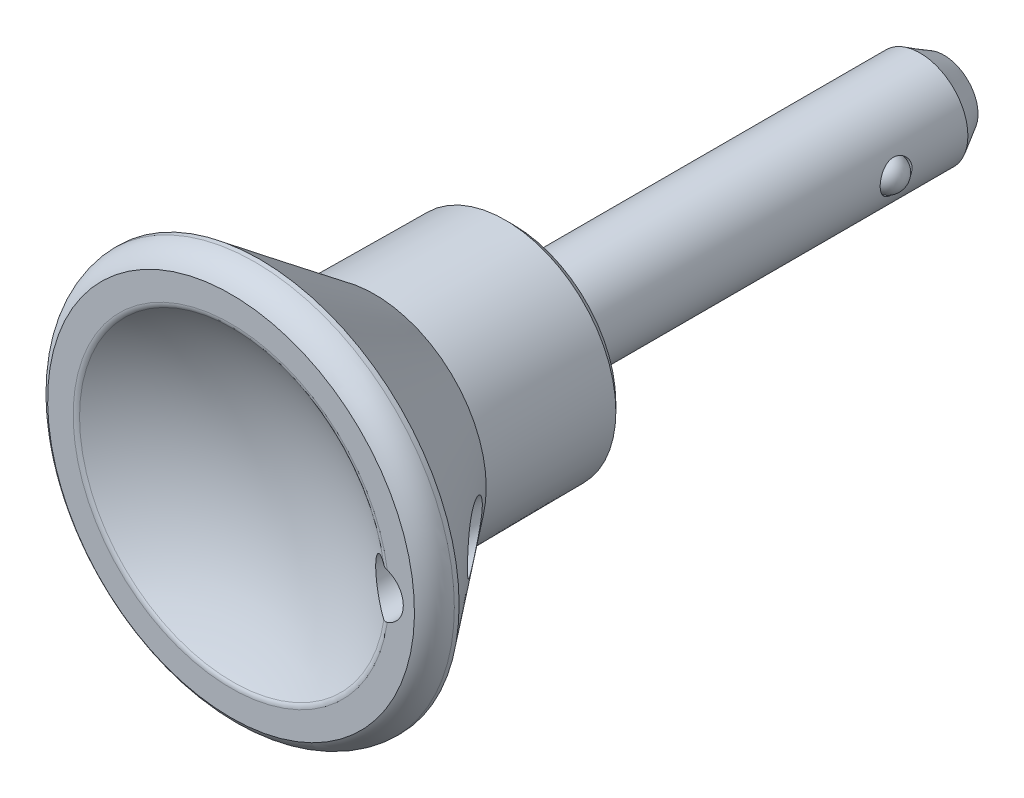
ISO-10303-21;
HEADER;
FILE_DESCRIPTION(('STEP AP214'),'2;1');
FILE_NAME('part.step','',(''),(''),'','','');
FILE_SCHEMA(('AUTOMOTIVE_DESIGN { 1 0 10303 214 1 1 1 1 }'));
ENDSEC;
DATA;
#1=APPLICATION_CONTEXT('core data for automotive mechanical design processes');
#2=APPLICATION_PROTOCOL_DEFINITION('international standard','automotive_design',2000,#1);
#3=PRODUCT_CONTEXT('',#1,'mechanical');
#4=PRODUCT('Part','Part','',(#3));
#5=PRODUCT_RELATED_PRODUCT_CATEGORY('part','',(#4));
#6=PRODUCT_DEFINITION_FORMATION('','',#4);
#7=PRODUCT_DEFINITION_CONTEXT('part definition',#1,'design');
#8=PRODUCT_DEFINITION('design','',#6,#7);
#9=PRODUCT_DEFINITION_SHAPE('','',#8);
#10=(LENGTH_UNIT() NAMED_UNIT(*) SI_UNIT(.MILLI.,.METRE.));
#11=(NAMED_UNIT(*) PLANE_ANGLE_UNIT() SI_UNIT($,.RADIAN.));
#12=(NAMED_UNIT(*) SI_UNIT($,.STERADIAN.) SOLID_ANGLE_UNIT());
#13=UNCERTAINTY_MEASURE_WITH_UNIT(LENGTH_MEASURE(1.E-05),#10,'distance_accuracy_value','');
#14=(GEOMETRIC_REPRESENTATION_CONTEXT(3) GLOBAL_UNCERTAINTY_ASSIGNED_CONTEXT((#13)) GLOBAL_UNIT_ASSIGNED_CONTEXT((#10,
#11,#12)) REPRESENTATION_CONTEXT('',''));
#15=CARTESIAN_POINT('',(0.,0.,0.));
#16=DIRECTION('',(0.,0.,1.));
#17=DIRECTION('',(1.,0.,0.));
#18=AXIS2_PLACEMENT_3D('',#15,#16,#17);
#19=CARTESIAN_POINT('',(2.49,0.,-21.));
#20=DIRECTION('',(0.,-1.,0.));
#21=DIRECTION('',(0.,0.,-1.));
#22=AXIS2_PLACEMENT_3D('',#19,#20,#21);
#23=SPHERICAL_SURFACE('',#22,1.01);
#24=CARTESIAN_POINT('',(2.63177446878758,0.,-21.));
#25=DIRECTION('',(1.,0.,0.));
#26=DIRECTION('',(0.,-1.,0.));
#27=AXIS2_PLACEMENT_3D('',#24,#25,#26);
#28=CIRCLE('',#27,1.);
#29=CARTESIAN_POINT('',(2.63177446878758,-0.999999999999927,-21.));
#30=VERTEX_POINT('',#29);
#31=EDGE_CURVE('E19',#30,#30,#28,.F.);
#32=ORIENTED_EDGE('',*,*,#31,.F.);
#33=EDGE_LOOP('',(#32));
#34=FACE_BOUND('',#33,.T.);
#35=ADVANCED_FACE('F15',(#34),#23,.T.);
#36=CARTESIAN_POINT('',(2.13397459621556,-2.15958441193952,-27.));
#37=DIRECTION('',(0.,0.,-1.));
#38=DIRECTION('',(-1.,0.,0.));
#39=AXIS2_PLACEMENT_3D('',#36,#37,#38);
#40=PLANE('',#39);
#41=CARTESIAN_POINT('',(0.,0.,-27.));
#42=DIRECTION('',(0.,0.,1.));
#43=DIRECTION('',(0.,-1.,0.));
#44=AXIS2_PLACEMENT_3D('',#41,#42,#43);
#45=CIRCLE('',#44,2.13397459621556);
#46=CARTESIAN_POINT('',(0.,-2.13397459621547,-27.));
#47=VERTEX_POINT('',#46);
#48=EDGE_CURVE('E149',#47,#47,#45,.T.);
#49=ORIENTED_EDGE('',*,*,#48,.F.);
#50=EDGE_LOOP('',(#49));
#51=FACE_BOUND('',#50,.T.);
#52=ADVANCED_FACE('F168',(#51),#40,.T.);
#53=CARTESIAN_POINT('',(2.63177446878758,0.,-21.));
#54=DIRECTION('',(1.,0.,0.));
#55=DIRECTION('',(0.,-1.,0.));
#56=AXIS2_PLACEMENT_3D('',#53,#54,#55);
#57=CYLINDRICAL_SURFACE('',#56,1.);
#58=ORIENTED_EDGE('',*,*,#31,.T.);
#59=EDGE_LOOP('',(#58));
#60=FACE_BOUND('',#59,.T.);
#61=CARTESIAN_POINT('',(3.,0.,-22.));
#62=CARTESIAN_POINT('',(2.99999782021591,-0.0544873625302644,-21.9999969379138));
#63=CARTESIAN_POINT('',(2.99849945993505,-0.109030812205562,-21.9955259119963));
#64=CARTESIAN_POINT('',(2.99265949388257,-0.216567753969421,-21.9777925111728));
#65=CARTESIAN_POINT('',(2.98831315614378,-0.269558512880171,-21.9645155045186));
#66=CARTESIAN_POINT('',(2.9772520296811,-0.372338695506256,-21.9296777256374));
#67=CARTESIAN_POINT('',(2.97054267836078,-0.422135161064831,-21.9081359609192));
#68=CARTESIAN_POINT('',(2.95544181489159,-0.517390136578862,-21.8574495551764));
#69=CARTESIAN_POINT('',(2.94705050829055,-0.562849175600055,-21.8283058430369));
#70=CARTESIAN_POINT('',(2.9291411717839,-0.649740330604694,-21.7621750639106));
#71=CARTESIAN_POINT('',(2.9195960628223,-0.691001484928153,-21.7249707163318));
#72=CARTESIAN_POINT('',(2.90060364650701,-0.766830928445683,-21.6442351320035));
#73=CARTESIAN_POINT('',(2.89115636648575,-0.801397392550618,-21.6007021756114));
#74=CARTESIAN_POINT('',(2.87313330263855,-0.863825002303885,-21.5070147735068));
#75=CARTESIAN_POINT('',(2.86459035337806,-0.891464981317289,-21.4567060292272));
#76=CARTESIAN_POINT('',(2.84975302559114,-0.937818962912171,-21.3518236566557));
#77=CARTESIAN_POINT('',(2.84345795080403,-0.956535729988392,-21.29725135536));
#78=CARTESIAN_POINT('',(2.83411303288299,-0.983873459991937,-21.187326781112));
#79=CARTESIAN_POINT('',(2.83096095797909,-0.992813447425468,-21.1320627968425));
#80=CARTESIAN_POINT('',(2.82795656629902,-1.00134112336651,-21.020736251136));
#81=CARTESIAN_POINT('',(2.82810323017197,-1.00093170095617,-20.9646739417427));
#82=CARTESIAN_POINT('',(2.83159014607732,-0.991019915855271,-20.8560634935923));
#83=CARTESIAN_POINT('',(2.83478414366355,-0.981933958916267,-20.8034718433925));
#84=CARTESIAN_POINT('',(2.84376655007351,-0.95560624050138,-20.7006068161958));
#85=CARTESIAN_POINT('',(2.84955528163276,-0.938363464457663,-20.6503337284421));
#86=CARTESIAN_POINT('',(2.86317929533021,-0.895938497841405,-20.5525859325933));
#87=CARTESIAN_POINT('',(2.87104608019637,-0.870632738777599,-20.5051694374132));
#88=CARTESIAN_POINT('',(2.88792606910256,-0.812887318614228,-20.4151267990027));
#89=CARTESIAN_POINT('',(2.89693954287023,-0.780445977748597,-20.3725017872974));
#90=CARTESIAN_POINT('',(2.91567165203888,-0.707355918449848,-20.2909155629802));
#91=CARTESIAN_POINT('',(2.92540257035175,-0.666367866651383,-20.2522605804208));
#92=CARTESIAN_POINT('',(2.94406631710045,-0.578354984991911,-20.1822794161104));
#93=CARTESIAN_POINT('',(2.95299879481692,-0.531327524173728,-20.1509564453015));
#94=CARTESIAN_POINT('',(2.96917806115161,-0.431907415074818,-20.0962803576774));
#95=CARTESIAN_POINT('',(2.97640595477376,-0.379463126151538,-20.073015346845));
#96=CARTESIAN_POINT('',(2.98821351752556,-0.271163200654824,-20.0357719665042));
#97=CARTESIAN_POINT('',(2.99279860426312,-0.215314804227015,-20.0217745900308));
#98=CARTESIAN_POINT('',(2.99719039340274,-0.13245787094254,-20.0084544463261));
#99=CARTESIAN_POINT('',(2.99824082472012,-0.106081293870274,-20.0052879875));
#100=CARTESIAN_POINT('',(2.9996461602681,-0.0531409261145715,-20.0010600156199));
#101=CARTESIAN_POINT('',(3.00000106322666,-0.0265771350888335,-19.9999985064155));
#102=CARTESIAN_POINT('',(2.99999782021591,0.0544873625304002,-20.0000030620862));
#103=CARTESIAN_POINT('',(2.99849945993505,0.109030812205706,-20.0044740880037));
#104=CARTESIAN_POINT('',(2.99265949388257,0.216567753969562,-20.0222074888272));
#105=CARTESIAN_POINT('',(2.98831315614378,0.2695585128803,-20.0354844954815));
#106=CARTESIAN_POINT('',(2.9772520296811,0.372338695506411,-20.0703222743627));
#107=CARTESIAN_POINT('',(2.97054267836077,0.422135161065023,-20.0918640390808));
#108=CARTESIAN_POINT('',(2.95544181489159,0.517390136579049,-20.1425504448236));
#109=CARTESIAN_POINT('',(2.94705050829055,0.5628491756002,-20.1716941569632));
#110=CARTESIAN_POINT('',(2.9291411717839,0.64974033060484,-20.2378249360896));
#111=CARTESIAN_POINT('',(2.91959606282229,0.691001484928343,-20.2750292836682));
#112=CARTESIAN_POINT('',(2.900603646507,0.766830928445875,-20.3557648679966));
#113=CARTESIAN_POINT('',(2.89115636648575,0.801397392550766,-20.3992978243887));
#114=CARTESIAN_POINT('',(2.87313330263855,0.863825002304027,-20.4929852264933));
#115=CARTESIAN_POINT('',(2.86459035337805,0.891464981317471,-20.5432939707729));
#116=CARTESIAN_POINT('',(2.84975302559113,0.937818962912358,-20.6481763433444));
#117=CARTESIAN_POINT('',(2.84345795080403,0.956535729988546,-20.7027486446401));
#118=CARTESIAN_POINT('',(2.834113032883,0.983873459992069,-20.8126732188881));
#119=CARTESIAN_POINT('',(2.83096095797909,0.992813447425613,-20.8679372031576));
#120=CARTESIAN_POINT('',(2.82795656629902,1.00134112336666,-20.979263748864));
#121=CARTESIAN_POINT('',(2.82810323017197,1.00093170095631,-21.0353260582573));
#122=CARTESIAN_POINT('',(2.83159014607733,0.99101991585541,-21.1439365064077));
#123=CARTESIAN_POINT('',(2.83478414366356,0.981933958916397,-21.1965281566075));
#124=CARTESIAN_POINT('',(2.84376655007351,0.95560624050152,-21.2993931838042));
#125=CARTESIAN_POINT('',(2.84955528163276,0.938363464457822,-21.349666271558));
#126=CARTESIAN_POINT('',(2.86317929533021,0.895938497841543,-21.4474140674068));
#127=CARTESIAN_POINT('',(2.87104608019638,0.870632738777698,-21.4948305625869));
#128=CARTESIAN_POINT('',(2.88792606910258,0.812887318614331,-21.5848732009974));
#129=CARTESIAN_POINT('',(2.89693954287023,0.780445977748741,-21.6274982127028));
#130=CARTESIAN_POINT('',(2.91567165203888,0.707355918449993,-21.7090844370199));
#131=CARTESIAN_POINT('',(2.92540257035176,0.666367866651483,-21.7477394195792));
#132=CARTESIAN_POINT('',(2.94406631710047,0.578354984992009,-21.8177205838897));
#133=CARTESIAN_POINT('',(2.95299879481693,0.531327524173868,-21.8490435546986));
#134=CARTESIAN_POINT('',(2.96917806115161,0.431907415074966,-21.9037196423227));
#135=CARTESIAN_POINT('',(2.97640595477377,0.37946312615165,-21.926984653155));
#136=CARTESIAN_POINT('',(2.98821351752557,0.271163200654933,-21.9642280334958));
#137=CARTESIAN_POINT('',(2.99279860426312,0.215314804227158,-21.9782254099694));
#138=CARTESIAN_POINT('',(2.99719039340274,0.132457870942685,-21.991545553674));
#139=CARTESIAN_POINT('',(2.99824082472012,0.106081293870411,-21.9947120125));
#140=CARTESIAN_POINT('',(2.9996461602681,0.0531409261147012,-21.9989399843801));
#141=CARTESIAN_POINT('',(3.00000106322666,0.0265771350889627,-22.0000014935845));
#142=CARTESIAN_POINT('',(3.,0.,-22.));
#143=B_SPLINE_CURVE_WITH_KNOTS('',3,(#61,#62,#63,#64,#65,#66,#67,#68,#69,#70,#71,#72,#73,#74,
#75,#76,#77,#78,#79,#80,#81,#82,#83,#84,#85,#86,#87,#88,#89,#90,#91,#92,#93,#94,#95,#96,#97,#98,
#99,#100,#101,#102,#103,#104,#105,#106,#107,#108,#109,#110,#111,#112,#113,#114,#115,#116,#117,
#118,#119,#120,#121,#122,#123,#124,#125,#126,#127,#128,#129,#130,#131,#132,#133,#134,#135,#136,
#137,#138,#139,#140,#141,#142),.UNSPECIFIED.,.T.,.F.,(4,2,2,2,2,2,2,2,2,2,2,2,2,2,2,2,2,2,2,2,2,
2,2,2,2,2,2,2,2,2,2,2,2,2,2,2,2,2,2,2,4),(0.,0.163359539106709,0.326991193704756,
0.490248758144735,0.653486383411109,0.8218424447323,0.990244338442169,1.16348424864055,
1.33667045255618,1.50401925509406,1.6713163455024,1.83096789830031,1.99063931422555,
2.15288605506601,2.3151710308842,2.48590393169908,2.65671146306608,2.82933165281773,
3.00159671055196,3.08127795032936,3.16095933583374,3.32431887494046,3.48795052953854,
3.65120809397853,3.8144457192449,3.9828017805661,4.15120367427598,4.32444358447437,
4.49762978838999,4.66497859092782,4.83227568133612,4.99192723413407,5.15159865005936,
5.31384539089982,5.476130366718,5.64686326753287,5.81767079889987,5.99029098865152,
6.16255604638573,6.24223728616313,6.32191867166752),.UNSPECIFIED.);
#144=CARTESIAN_POINT('',(3.,0.,-22.));
#145=VERTEX_POINT('',#144);
#146=EDGE_CURVE('E141',#145,#145,#143,.T.);
#147=ORIENTED_EDGE('',*,*,#146,.F.);
#148=EDGE_LOOP('',(#147));
#149=FACE_BOUND('',#148,.T.);
#150=ADVANCED_FACE('F164',(#60,#149),#57,.F.);
#151=CARTESIAN_POINT('',(0.,0.,-27.));
#152=DIRECTION('',(0.,0.,1.));
#153=DIRECTION('',(0.,-1.,0.));
#154=AXIS2_PLACEMENT_3D('',#151,#152,#153);
#155=CONICAL_SURFACE('',#154,2.13397459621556,0.523598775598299);
#156=CARTESIAN_POINT('',(0.,0.,-25.5));
#157=DIRECTION('',(0.,0.,1.));
#158=DIRECTION('',(1.,0.,0.));
#159=AXIS2_PLACEMENT_3D('',#156,#157,#158);
#160=CIRCLE('',#159,3.);
#161=CARTESIAN_POINT('',(3.,0.,-25.5));
#162=VERTEX_POINT('',#161);
#163=EDGE_CURVE('E137',#162,#162,#160,.T.);
#164=ORIENTED_EDGE('',*,*,#163,.F.);
#165=EDGE_LOOP('',(#164));
#166=FACE_BOUND('',#165,.T.);
#167=ORIENTED_EDGE('',*,*,#48,.T.);
#168=EDGE_LOOP('',(#167));
#169=FACE_BOUND('',#168,.T.);
#170=ADVANCED_FACE('F167',(#166,#169),#155,.T.);
#171=CARTESIAN_POINT('',(0.,0.,0.));
#172=DIRECTION('',(0.,0.,1.));
#173=DIRECTION('',(0.,-1.,0.));
#174=AXIS2_PLACEMENT_3D('',#171,#172,#173);
#175=CYLINDRICAL_SURFACE('',#174,3.);
#176=ORIENTED_EDGE('',*,*,#146,.T.);
#177=EDGE_LOOP('',(#176));
#178=FACE_BOUND('',#177,.T.);
#179=CARTESIAN_POINT('',(0.,0.,0.));
#180=DIRECTION('',(0.,0.,1.));
#181=DIRECTION('',(0.,-1.,0.));
#182=AXIS2_PLACEMENT_3D('',#179,#180,#181);
#183=CIRCLE('',#182,3.);
#184=CARTESIAN_POINT('',(0.,-3.,0.));
#185=VERTEX_POINT('',#184);
#186=EDGE_CURVE('E140',#185,#185,#183,.T.);
#187=ORIENTED_EDGE('',*,*,#186,.F.);
#188=EDGE_LOOP('',(#187));
#189=FACE_BOUND('',#188,.T.);
#190=ORIENTED_EDGE('',*,*,#163,.T.);
#191=EDGE_LOOP('',(#190));
#192=FACE_BOUND('',#191,.T.);
#193=ADVANCED_FACE('F160',(#178,#189,#192),#175,.T.);
#194=CARTESIAN_POINT('',(6.4240762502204,-6.50116727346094,0.));
#195=DIRECTION('',(0.,0.,-1.));
#196=DIRECTION('',(-1.,0.,0.));
#197=AXIS2_PLACEMENT_3D('',#194,#195,#196);
#198=PLANE('',#197);
#199=ORIENTED_EDGE('',*,*,#186,.T.);
#200=EDGE_LOOP('',(#199));
#201=FACE_BOUND('',#200,.T.);
#202=CARTESIAN_POINT('',(0.,0.,0.));
#203=DIRECTION('',(0.,0.,1.));
#204=DIRECTION('',(0.,-1.,0.));
#205=AXIS2_PLACEMENT_3D('',#202,#203,#204);
#206=CIRCLE('',#205,6.4240762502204);
#207=CARTESIAN_POINT('',(0.,-6.4240762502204,0.));
#208=VERTEX_POINT('',#207);
#209=EDGE_CURVE('E105',#208,#208,#206,.T.);
#210=ORIENTED_EDGE('',*,*,#209,.F.);
#211=EDGE_LOOP('',(#210));
#212=FACE_BOUND('',#211,.T.);
#213=ADVANCED_FACE('F184',(#201,#212),#198,.T.);
#214=CARTESIAN_POINT('',(0.,0.,0.));
#215=DIRECTION('',(0.,0.,1.));
#216=DIRECTION('',(0.,-1.,0.));
#217=AXIS2_PLACEMENT_3D('',#214,#215,#216);
#218=CONICAL_SURFACE('',#217,6.4240762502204,0.789761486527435);
#219=CARTESIAN_POINT('',(0.,0.,0.499980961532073));
#220=DIRECTION('',(0.,0.,-1.));
#221=DIRECTION('',(1.,0.,0.));
#222=AXIS2_PLACEMENT_3D('',#219,#220,#221);
#223=CIRCLE('',#222,6.92843951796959);
#224=CARTESIAN_POINT('',(6.92843951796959,0.,0.499980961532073));
#225=VERTEX_POINT('',#224);
#226=EDGE_CURVE('E130',#225,#225,#223,.F.);
#227=ORIENTED_EDGE('',*,*,#226,.F.);
#228=EDGE_LOOP('',(#227));
#229=FACE_BOUND('',#228,.T.);
#230=ORIENTED_EDGE('',*,*,#209,.T.);
#231=EDGE_LOOP('',(#230));
#232=FACE_BOUND('',#231,.T.);
#233=ADVANCED_FACE('F188',(#229,#232),#218,.T.);
#234=CARTESIAN_POINT('',(0.,0.,0.499980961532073));
#235=DIRECTION('',(0.,0.,1.));
#236=DIRECTION('',(0.,-1.,0.));
#237=AXIS2_PLACEMENT_3D('',#234,#235,#236);
#238=CONICAL_SURFACE('',#237,6.92843951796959,0.00872664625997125);
#239=CARTESIAN_POINT('',(0.,0.,8.7));
#240=DIRECTION('',(0.,0.,-1.));
#241=DIRECTION('',(1.,0.,0.));
#242=AXIS2_PLACEMENT_3D('',#239,#240,#241);
#243=CIRCLE('',#242,7.);
#244=CARTESIAN_POINT('',(7.,0.,8.7));
#245=VERTEX_POINT('',#244);
#246=EDGE_CURVE('E125',#245,#245,#243,.F.);
#247=ORIENTED_EDGE('',*,*,#246,.F.);
#248=EDGE_LOOP('',(#247));
#249=FACE_BOUND('',#248,.T.);
#250=ORIENTED_EDGE('',*,*,#226,.T.);
#251=EDGE_LOOP('',(#250));
#252=FACE_BOUND('',#251,.T.);
#253=ADVANCED_FACE('F211',(#249,#252),#238,.T.);
#254=CARTESIAN_POINT('',(0.,0.,16.2));
#255=DIRECTION('',(0.,0.,1.));
#256=DIRECTION('',(0.,-1.,0.));
#257=AXIS2_PLACEMENT_3D('',#254,#255,#256);
#258=CYLINDRICAL_SURFACE('',#257,12.5);
#259=CARTESIAN_POINT('',(0.,0.,15.9));
#260=DIRECTION('',(0.,0.,-1.));
#261=DIRECTION('',(1.,0.,0.));
#262=AXIS2_PLACEMENT_3D('',#259,#260,#261);
#263=CIRCLE('',#262,12.5);
#264=CARTESIAN_POINT('',(12.5,0.,15.9));
#265=VERTEX_POINT('',#264);
#266=EDGE_CURVE('E126',#265,#265,#263,.T.);
#267=ORIENTED_EDGE('',*,*,#266,.F.);
#268=EDGE_LOOP('',(#267));
#269=FACE_BOUND('',#268,.T.);
#270=CARTESIAN_POINT('',(0.,0.,16.2));
#271=DIRECTION('',(0.,0.,1.));
#272=DIRECTION('',(0.,-1.,0.));
#273=AXIS2_PLACEMENT_3D('',#270,#271,#272);
#274=CIRCLE('',#273,12.5);
#275=CARTESIAN_POINT('',(0.,-12.5000000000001,16.2));
#276=VERTEX_POINT('',#275);
#277=EDGE_CURVE('E104',#276,#276,#274,.T.);
#278=ORIENTED_EDGE('',*,*,#277,.F.);
#279=EDGE_LOOP('',(#278));
#280=FACE_BOUND('',#279,.T.);
#281=ADVANCED_FACE('F206',(#269,#280),#258,.T.);
#282=CARTESIAN_POINT('',(0.,0.,8.7));
#283=DIRECTION('',(0.,0.,1.));
#284=DIRECTION('',(0.,-1.,0.));
#285=AXIS2_PLACEMENT_3D('',#282,#283,#284);
#286=CONICAL_SURFACE('',#285,7.,0.65233090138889);
#287=CARTESIAN_POINT('',(9.05806451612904,-1.48036050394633,11.5515077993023));
#288=CARTESIAN_POINT('',(8.99141512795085,-1.4694682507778,11.4631001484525));
#289=CARTESIAN_POINT('',(8.92550148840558,-1.4540855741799,11.3746905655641));
#290=CARTESIAN_POINT('',(8.79556366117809,-1.4142717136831,11.1984472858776));
#291=CARTESIAN_POINT('',(8.73154031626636,-1.38983655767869,11.1106138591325));
#292=CARTESIAN_POINT('',(8.60623315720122,-1.3317042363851,10.9367585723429));
#293=CARTESIAN_POINT('',(8.54493725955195,-1.29805393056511,10.8507298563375));
#294=CARTESIAN_POINT('',(8.42544336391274,-1.220743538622,10.6811358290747));
#295=CARTESIAN_POINT('',(8.36724184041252,-1.17709515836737,10.5975677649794));
#296=CARTESIAN_POINT('',(8.26922940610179,-1.0911470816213,10.4552980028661));
#297=CARTESIAN_POINT('',(8.22852162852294,-1.05135683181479,10.3957022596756));
#298=CARTESIAN_POINT('',(8.14989980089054,-0.964725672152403,10.2796936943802));
#299=CARTESIAN_POINT('',(8.11198828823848,-0.917878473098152,10.2232837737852));
#300=CARTESIAN_POINT('',(8.03963417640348,-0.815744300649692,10.1148327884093));
#301=CARTESIAN_POINT('',(8.00522654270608,-0.760383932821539,10.0628364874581));
#302=CARTESIAN_POINT('',(7.94192848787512,-0.640477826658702,9.96655825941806));
#303=CARTESIAN_POINT('',(7.91302454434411,-0.575955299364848,9.92225744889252));
#304=CARTESIAN_POINT('',(7.87251252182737,-0.463057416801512,9.85986137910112));
#305=CARTESIAN_POINT('',(7.85846623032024,-0.417573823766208,9.8381417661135));
#306=CARTESIAN_POINT('',(7.83441768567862,-0.323152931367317,9.80086955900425));
#307=CARTESIAN_POINT('',(7.82440740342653,-0.274222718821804,9.78530472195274));
#308=CARTESIAN_POINT('',(7.81132335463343,-0.187620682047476,9.76493500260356));
#309=CARTESIAN_POINT('',(7.80710048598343,-0.150537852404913,9.75835039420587));
#310=CARTESIAN_POINT('',(7.80143783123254,-0.0756412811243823,9.74951765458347));
#311=CARTESIAN_POINT('',(7.79999798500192,-0.0378275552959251,9.74726942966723));
#312=CARTESIAN_POINT('',(7.8000025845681,0.0485200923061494,9.74727695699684));
#313=CARTESIAN_POINT('',(7.80237736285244,0.0970629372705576,9.75098545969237));
#314=CARTESIAN_POINT('',(7.81164444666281,0.19265118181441,9.76543406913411));
#315=CARTESIAN_POINT('',(7.81854204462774,0.239694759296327,9.77618241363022));
#316=CARTESIAN_POINT('',(7.83829683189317,0.341610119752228,9.8068877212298));
#317=CARTESIAN_POINT('',(7.85215507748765,0.395817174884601,9.82838678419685));
#318=CARTESIAN_POINT('',(7.88451983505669,0.499375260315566,9.87838349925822));
#319=CARTESIAN_POINT('',(7.90303499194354,0.548717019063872,9.90689416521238));
#320=CARTESIAN_POINT('',(7.95423062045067,0.667068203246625,9.98533549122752));
#321=CARTESIAN_POINT('',(7.9892435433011,0.732796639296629,10.0386516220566));
#322=CARTESIAN_POINT('',(8.06472209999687,0.85393242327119,10.1525776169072));
#323=CARTESIAN_POINT('',(8.10520064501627,0.909314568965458,10.2132047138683));
#324=CARTESIAN_POINT('',(8.18383548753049,1.00367842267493,10.3298982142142));
#325=CARTESIAN_POINT('',(8.22147534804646,1.04387385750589,10.3853483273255));
#326=CARTESIAN_POINT('',(8.29898008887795,1.11841530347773,10.4986148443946));
#327=CARTESIAN_POINT('',(8.33884646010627,1.15275733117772,10.556432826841));
#328=CARTESIAN_POINT('',(8.42042546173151,1.21614962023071,10.6737908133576));
#329=CARTESIAN_POINT('',(8.46214099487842,1.24519116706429,10.7333334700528));
#330=CARTESIAN_POINT('',(8.54706483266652,1.29830522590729,10.8535675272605));
#331=CARTESIAN_POINT('',(8.59027353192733,1.32237641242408,10.9142592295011));
#332=CARTESIAN_POINT('',(8.69675324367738,1.3751305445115,11.0626135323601));
#333=CARTESIAN_POINT('',(8.76068198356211,1.40136483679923,11.150681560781));
#334=CARTESIAN_POINT('',(8.89058399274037,1.44466814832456,11.3275915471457));
#335=CARTESIAN_POINT('',(8.95655819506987,1.4617329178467,11.4164338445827));
#336=CARTESIAN_POINT('',(9.09008194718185,1.48679092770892,11.5942301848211));
#337=CARTESIAN_POINT('',(9.15763151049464,1.49478409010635,11.683184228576));
#338=CARTESIAN_POINT('',(9.293788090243,1.50153429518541,11.8605390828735));
#339=CARTESIAN_POINT('',(9.36239469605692,1.50029483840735,11.9489400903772));
#340=CARTESIAN_POINT('',(9.5389643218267,1.48478544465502,12.1740527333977));
#341=CARTESIAN_POINT('',(9.64741582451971,1.46359594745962,12.3100469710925));
#342=CARTESIAN_POINT('',(9.80896256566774,1.41213790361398,12.5095339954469));
#343=CARTESIAN_POINT('',(9.86259038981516,1.39172486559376,12.5752398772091));
#344=CARTESIAN_POINT('',(9.96902195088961,1.343806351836,12.7046889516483));
#345=CARTESIAN_POINT('',(10.021826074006,1.31630431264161,12.7684330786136));
#346=CARTESIAN_POINT('',(10.1398540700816,1.24522266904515,12.9099256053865));
#347=CARTESIAN_POINT('',(10.2046458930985,1.19931241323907,12.9868895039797));
#348=CARTESIAN_POINT('',(10.3299573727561,1.0935701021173,13.1345591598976));
#349=CARTESIAN_POINT('',(10.3904821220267,1.0337550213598,13.2052724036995));
#350=CARTESIAN_POINT('',(10.4895745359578,0.916081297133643,13.3202576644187));
#351=CARTESIAN_POINT('',(10.5297805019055,0.861692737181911,13.3666468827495));
#352=CARTESIAN_POINT('',(10.6043536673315,0.743973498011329,13.452316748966));
#353=CARTESIAN_POINT('',(10.6387288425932,0.680655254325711,13.4916071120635));
#354=CARTESIAN_POINT('',(10.6925693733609,0.560424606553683,13.5529446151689));
#355=CARTESIAN_POINT('',(10.7136506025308,0.505208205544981,13.5768833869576));
#356=CARTESIAN_POINT('',(10.7495749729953,0.390302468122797,13.6176027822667));
#357=CARTESIAN_POINT('',(10.7644289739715,0.33062113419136,13.6343958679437));
#358=CARTESIAN_POINT('',(10.7836092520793,0.225596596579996,13.6560593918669));
#359=CARTESIAN_POINT('',(10.7897268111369,0.180990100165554,13.6629607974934));
#360=CARTESIAN_POINT('',(10.7979243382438,0.0909301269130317,13.6722061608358));
#361=CARTESIAN_POINT('',(10.8000037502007,0.0454765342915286,13.6745494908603));
#362=CARTESIAN_POINT('',(10.799994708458,-0.0641674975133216,13.6745397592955));
#363=CARTESIAN_POINT('',(10.795841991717,-0.128380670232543,13.6698606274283));
#364=CARTESIAN_POINT('',(10.7796239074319,-0.254506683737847,13.6515601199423));
#365=CARTESIAN_POINT('',(10.7675483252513,-0.316416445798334,13.6379272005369));
#366=CARTESIAN_POINT('',(10.7366563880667,-0.435644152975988,13.6029693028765));
#367=CARTESIAN_POINT('',(10.7178919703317,-0.492993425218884,13.5817035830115));
#368=CARTESIAN_POINT('',(10.6748799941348,-0.602645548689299,13.5328118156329));
#369=CARTESIAN_POINT('',(10.6506301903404,-0.654946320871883,13.5051831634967));
#370=CARTESIAN_POINT('',(10.5859735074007,-0.776472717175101,13.4312530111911));
#371=CARTESIAN_POINT('',(10.5432056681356,-0.84272820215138,13.3821425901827));
#372=CARTESIAN_POINT('',(10.4516580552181,-0.964099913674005,13.2763616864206));
#373=CARTESIAN_POINT('',(10.4028645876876,-1.01918998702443,13.2196739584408));
#374=CARTESIAN_POINT('',(10.2766029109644,-1.14345503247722,13.0719673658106));
#375=CARTESIAN_POINT('',(10.1967753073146,-1.20635475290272,12.9777102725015));
#376=CARTESIAN_POINT('',(10.0329696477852,-1.31236147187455,12.7820645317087));
#377=CARTESIAN_POINT('',(9.94898466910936,-1.35543413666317,12.6806638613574));
#378=CARTESIAN_POINT('',(9.79718248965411,-1.41705079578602,12.4951419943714));
#379=CARTESIAN_POINT('',(9.72964852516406,-1.43883766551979,12.4118303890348));
#380=CARTESIAN_POINT('',(9.59439459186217,-1.47247845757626,12.2433068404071));
#381=CARTESIAN_POINT('',(9.52667453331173,-1.48432617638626,12.1580937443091));
#382=CARTESIAN_POINT('',(9.39151350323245,-1.49875216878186,11.9862568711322));
#383=CARTESIAN_POINT('',(9.32407407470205,-1.50130123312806,11.8996295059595));
#384=CARTESIAN_POINT('',(9.19020636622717,-1.49747387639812,11.725837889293));
#385=CARTESIAN_POINT('',(9.12377782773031,-1.49109977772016,11.6386737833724));
#386=CARTESIAN_POINT('',(9.05806451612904,-1.48036050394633,11.5515077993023));
#387=B_SPLINE_CURVE_WITH_KNOTS('',3,(#287,#288,#289,#290,#291,#292,#293,#294,#295,#296,#297,
#298,#299,#300,#301,#302,#303,#304,#305,#306,#307,#308,#309,#310,#311,#312,#313,#314,#315,#316,
#317,#318,#319,#320,#321,#322,#323,#324,#325,#326,#327,#328,#329,#330,#331,#332,#333,#334,#335,
#336,#337,#338,#339,#340,#341,#342,#343,#344,#345,#346,#347,#348,#349,#350,#351,#352,#353,#354,
#355,#356,#357,#358,#359,#360,#361,#362,#363,#364,#365,#366,#367,#368,#369,#370,#371,#372,#373,
#374,#375,#376,#377,#378,#379,#380,#381,#382,#383,#384,#385,#386),.UNSPECIFIED.,.T.,.F.,(4,2,2,
2,2,2,2,2,2,2,2,2,2,2,2,2,2,2,2,2,2,2,2,2,2,2,2,2,2,2,2,2,2,2,2,2,2,2,2,2,2,2,2,2,2,2,2,2,2,4),
(0.,0.3336584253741,0.6674634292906,0.999601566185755,1.33135280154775,1.57826788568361,
1.8254043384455,2.07480511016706,2.32358497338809,2.48005639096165,2.63621497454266,
2.74958301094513,2.86294859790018,3.00835870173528,3.1539392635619,3.33275537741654,
3.51190592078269,3.78514778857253,4.05904679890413,4.29316938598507,4.52745067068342,
4.76211373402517,4.99683929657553,5.33221840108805,5.6677528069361,6.0032900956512,
6.33870017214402,6.8622621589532,7.12372139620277,7.38505412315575,7.71589293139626,
8.04632996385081,8.29159071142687,8.53651321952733,8.72709088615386,8.91733480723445,
9.05359735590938,9.18987866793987,9.3821719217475,9.57471358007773,9.76579164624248,
9.95694806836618,10.2340958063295,10.5118854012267,10.9254412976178,11.3397106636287,
11.6675345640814,11.9955629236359,12.3246208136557,12.6535930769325),.UNSPECIFIED.);
#388=CARTESIAN_POINT('',(9.05806451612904,-1.48036050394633,11.5515077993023));
#389=VERTEX_POINT('',#388);
#390=EDGE_CURVE('E53',#389,#389,#387,.T.);
#391=ORIENTED_EDGE('',*,*,#390,.F.);
#392=EDGE_LOOP('',(#391));
#393=FACE_BOUND('',#392,.T.);
#394=ORIENTED_EDGE('',*,*,#266,.T.);
#395=EDGE_LOOP('',(#394));
#396=FACE_BOUND('',#395,.T.);
#397=ORIENTED_EDGE('',*,*,#246,.T.);
#398=EDGE_LOOP('',(#397));
#399=FACE_BOUND('',#398,.T.);
#400=ADVANCED_FACE('F203',(#393,#396,#399),#286,.T.);
#401=CARTESIAN_POINT('',(0.,0.,15.9596620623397));
#402=DIRECTION('',(0.,0.,1.));
#403=DIRECTION('',(0.,-1.,0.));
#404=AXIS2_PLACEMENT_3D('',#401,#402,#403);
#405=TOROIDAL_SURFACE('',#404,10.5144930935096,2.);
#406=ORIENTED_EDGE('',*,*,#277,.T.);
#407=EDGE_LOOP('',(#406));
#408=FACE_BOUND('',#407,.T.);
#409=CARTESIAN_POINT('',(0.,0.,17.7));
#410=DIRECTION('',(0.,0.,1.));
#411=DIRECTION('',(0.,-1.,0.));
#412=AXIS2_PLACEMENT_3D('',#409,#410,#411);
#413=CIRCLE('',#412,11.5);
#414=CARTESIAN_POINT('',(0.,-11.5000000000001,17.7));
#415=VERTEX_POINT('',#414);
#416=EDGE_CURVE('E58',#415,#415,#413,.T.);
#417=ORIENTED_EDGE('',*,*,#416,.F.);
#418=EDGE_LOOP('',(#417));
#419=FACE_BOUND('',#418,.T.);
#420=ADVANCED_FACE('F87',(#408,#419),#405,.T.);
#421=CARTESIAN_POINT('',(9.3,0.,9.74688245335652));
#422=DIRECTION('',(0.,0.,1.));
#423=DIRECTION('',(0.,-1.,0.));
#424=AXIS2_PLACEMENT_3D('',#421,#422,#423);
#425=CYLINDRICAL_SURFACE('',#424,1.5);
#426=ORIENTED_EDGE('',*,*,#390,.T.);
#427=EDGE_LOOP('',(#426));
#428=FACE_BOUND('',#427,.T.);
#429=CARTESIAN_POINT('',(9.79838709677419,-1.41478277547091,17.7));
#430=CARTESIAN_POINT('',(9.76967463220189,-1.42493393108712,17.7000278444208));
#431=CARTESIAN_POINT('',(9.74057958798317,-1.43416331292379,17.6978154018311));
#432=CARTESIAN_POINT('',(9.68339626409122,-1.45046247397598,17.688811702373));
#433=CARTESIAN_POINT('',(9.65530246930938,-1.45758512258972,17.6821493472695));
#434=CARTESIAN_POINT('',(9.60265119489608,-1.46937623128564,17.6649718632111));
#435=CARTESIAN_POINT('',(9.57800180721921,-1.47420693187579,17.6548534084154));
#436=CARTESIAN_POINT('',(9.52973678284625,-1.48251466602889,17.6305344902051));
#437=CARTESIAN_POINT('',(9.50616459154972,-1.4859533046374,17.6162348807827));
#438=CARTESIAN_POINT('',(9.48387096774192,-1.48868783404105,17.6));
#439=B_SPLINE_CURVE_WITH_KNOTS('',3,(#429,#430,#431,#432,#433,#434,#435,#436,#437,#438),
.UNSPECIFIED.,.F.,.F.,(4,2,2,2,4),(0.,0.091347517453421,0.18015749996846,0.261045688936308,
0.344033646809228),.UNSPECIFIED.);
#440=CARTESIAN_POINT('',(9.79838709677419,-1.41478277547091,17.7));
#441=VERTEX_POINT('',#440);
#442=CARTESIAN_POINT('',(9.48387096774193,-1.48868783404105,17.6));
#443=VERTEX_POINT('',#442);
#444=EDGE_CURVE('E45',#441,#443,#439,.T.);
#445=ORIENTED_EDGE('',*,*,#444,.F.);
#446=CARTESIAN_POINT('',(9.3,0.,17.7));
#447=DIRECTION('',(0.,0.,1.));
#448=DIRECTION('',(0.,-1.,0.));
#449=AXIS2_PLACEMENT_3D('',#446,#447,#448);
#450=CIRCLE('',#449,1.5);
#451=CARTESIAN_POINT('',(9.79838709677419,1.41478277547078,17.7));
#452=VERTEX_POINT('',#451);
#453=EDGE_CURVE('E33',#452,#441,#450,.F.);
#454=ORIENTED_EDGE('',*,*,#453,.F.);
#455=CARTESIAN_POINT('',(9.79838709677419,1.41478277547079,17.7));
#456=CARTESIAN_POINT('',(9.76967463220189,1.424933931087,17.7000278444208));
#457=CARTESIAN_POINT('',(9.74057958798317,1.43416331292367,17.6978154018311));
#458=CARTESIAN_POINT('',(9.68339626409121,1.45046247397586,17.688811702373));
#459=CARTESIAN_POINT('',(9.65530246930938,1.45758512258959,17.6821493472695));
#460=CARTESIAN_POINT('',(9.60265119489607,1.46937623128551,17.6649718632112));
#461=CARTESIAN_POINT('',(9.5780018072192,1.47420693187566,17.6548534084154));
#462=CARTESIAN_POINT('',(9.52973678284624,1.48251466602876,17.6305344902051));
#463=CARTESIAN_POINT('',(9.50616459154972,1.48595330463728,17.6162348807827));
#464=CARTESIAN_POINT('',(9.48387096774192,1.48868783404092,17.6));
#465=B_SPLINE_CURVE_WITH_KNOTS('',3,(#455,#456,#457,#458,#459,#460,#461,#462,#463,#464),
.UNSPECIFIED.,.F.,.F.,(4,2,2,2,4),(0.,0.0913475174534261,0.180157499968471,0.261045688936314,
0.344033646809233),.UNSPECIFIED.);
#466=CARTESIAN_POINT('',(9.48387096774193,1.48868783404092,17.6));
#467=VERTEX_POINT('',#466);
#468=EDGE_CURVE('E46',#452,#467,#465,.T.);
#469=ORIENTED_EDGE('',*,*,#468,.T.);
#470=CARTESIAN_POINT('',(9.48387096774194,-1.48868783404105,17.6));
#471=CARTESIAN_POINT('',(9.38181447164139,-1.50126046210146,17.5258231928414));
#472=CARTESIAN_POINT('',(9.27847034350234,-1.5033940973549,17.4514075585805));
#473=CARTESIAN_POINT('',(9.07150168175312,-1.48616897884,17.3036113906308));
#474=CARTESIAN_POINT('',(8.96788247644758,-1.46662385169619,17.230245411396));
#475=CARTESIAN_POINT('',(8.76570217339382,-1.40554015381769,17.0882393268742));
#476=CARTESIAN_POINT('',(8.66709675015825,-1.36425592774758,17.0195547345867));
#477=CARTESIAN_POINT('',(8.47807170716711,-1.25938003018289,16.8888158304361));
#478=CARTESIAN_POINT('',(8.38761877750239,-1.19588484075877,16.8267343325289));
#479=CARTESIAN_POINT('',(8.24568836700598,-1.06979552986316,16.7298945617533));
#480=CARTESIAN_POINT('',(8.19079097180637,-1.01295594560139,16.692612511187));
#481=CARTESIAN_POINT('',(8.08925811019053,-0.889102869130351,16.6238983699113));
#482=CARTESIAN_POINT('',(8.04262373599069,-0.822088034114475,16.5924670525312));
#483=CARTESIAN_POINT('',(7.95961243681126,-0.67845305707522,16.5366671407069));
#484=CARTESIAN_POINT('',(7.9233211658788,-0.601759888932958,16.5123574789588));
#485=CARTESIAN_POINT('',(7.86387797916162,-0.441385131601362,16.4726071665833));
#486=CARTESIAN_POINT('',(7.84069382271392,-0.357721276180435,16.4571447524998));
#487=CARTESIAN_POINT('',(7.81665644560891,-0.227526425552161,16.4411240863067));
#488=CARTESIAN_POINT('',(7.81042627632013,-0.182354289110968,16.4369745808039));
#489=CARTESIAN_POINT('',(7.80209606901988,-0.0914654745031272,16.4314273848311));
#490=CARTESIAN_POINT('',(7.79999581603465,-0.0457488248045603,16.4300295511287));
#491=CARTESIAN_POINT('',(7.8000067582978,0.0738974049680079,16.4300365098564));
#492=CARTESIAN_POINT('',(7.80550430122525,0.147878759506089,16.4336949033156));
#493=CARTESIAN_POINT('',(7.82172596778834,0.257047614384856,16.4445026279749));
#494=CARTESIAN_POINT('',(7.82847272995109,0.293170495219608,16.4489987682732));
#495=CARTESIAN_POINT('',(7.84452794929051,0.364609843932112,16.4597055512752));
#496=CARTESIAN_POINT('',(7.85383787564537,0.399925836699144,16.4659171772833));
#497=CARTESIAN_POINT('',(7.88533418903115,0.503926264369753,16.4869492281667));
#498=CARTESIAN_POINT('',(7.91114789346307,0.571060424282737,16.5042071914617));
#499=CARTESIAN_POINT('',(7.97122958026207,0.699580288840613,16.5444764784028));
#500=CARTESIAN_POINT('',(8.00550445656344,0.760961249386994,16.5674924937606));
#501=CARTESIAN_POINT('',(8.06330229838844,0.849663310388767,16.6064232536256));
#502=CARTESIAN_POINT('',(8.08431449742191,0.879441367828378,16.6205962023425));
#503=CARTESIAN_POINT('',(8.12808579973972,0.936974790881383,16.6501700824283));
#504=CARTESIAN_POINT('',(8.15084283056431,0.964732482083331,16.6655695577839));
#505=CARTESIAN_POINT('',(8.22150377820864,1.0449510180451,16.7134720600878));
#506=CARTESIAN_POINT('',(8.27178709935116,1.09434151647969,16.7476721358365));
#507=CARTESIAN_POINT('',(8.38550726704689,1.19170689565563,16.8253434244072));
#508=CARTESIAN_POINT('',(8.44976642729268,1.23822096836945,16.8694253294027));
#509=CARTESIAN_POINT('',(8.58287694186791,1.31978473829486,16.961227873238));
#510=CARTESIAN_POINT('',(8.65173257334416,1.35482357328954,17.0089519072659));
#511=CARTESIAN_POINT('',(8.76337185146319,1.40144242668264,17.0867690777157));
#512=CARTESIAN_POINT('',(8.80522580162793,1.41674274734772,17.1160369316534));
#513=CARTESIAN_POINT('',(8.8896220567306,1.4434494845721,17.1752539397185));
#514=CARTESIAN_POINT('',(8.93216367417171,1.45485956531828,17.2052024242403));
#515=CARTESIAN_POINT('',(9.06048356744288,1.48334429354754,17.2958544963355));
#516=CARTESIAN_POINT('',(9.14699642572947,1.49468964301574,17.3573922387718));
#517=CARTESIAN_POINT('',(9.31725275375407,1.50223877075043,17.4793658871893));
#518=CARTESIAN_POINT('',(9.40099551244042,1.49891929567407,17.5397732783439));
#519=CARTESIAN_POINT('',(9.48387096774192,1.48868783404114,17.6));
#520=B_SPLINE_CURVE_WITH_KNOTS('',3,(#470,#471,#472,#473,#474,#475,#476,#477,#478,#479,#480,
#481,#482,#483,#484,#485,#486,#487,#488,#489,#490,#491,#492,#493,#494,#495,#496,#497,#498,#499,
#500,#501,#502,#503,#504,#505,#506,#507,#508,#509,#510,#511,#512,#513,#514,#515,#516,#517,#518,
#519),.UNSPECIFIED.,.F.,.F.,(4,2,2,2,2,2,2,2,2,2,2,2,2,2,2,2,2,2,2,2,2,2,2,2,4),(0.,
0.380173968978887,0.763641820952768,1.14271969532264,1.52017093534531,1.7812816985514,
2.04242694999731,2.30567583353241,2.56827433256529,2.70539664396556,2.84251181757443,
3.06399194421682,3.17494513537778,3.28596205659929,3.50680011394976,3.72781870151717,
3.84503226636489,3.96210870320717,4.19632161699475,4.4675973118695,4.73912905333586,
4.89893578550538,5.05859157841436,5.37775215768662,5.6866146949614),.UNSPECIFIED.);
#521=EDGE_CURVE('E51',#443,#467,#520,.T.);
#522=ORIENTED_EDGE('',*,*,#521,.F.);
#523=EDGE_LOOP('',(#445,#454,#469,#522));
#524=FACE_BOUND('',#523,.T.);
#525=ADVANCED_FACE('F49',(#428,#524),#425,.F.);
#526=CARTESIAN_POINT('',(0.,-1.06141094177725E-13,30.4));
#527=DIRECTION('',(0.,-1.,0.));
#528=DIRECTION('',(0.,0.,1.));
#529=AXIS2_PLACEMENT_3D('',#526,#527,#528);
#530=SPHERICAL_SURFACE('',#529,16.);
#531=ORIENTED_EDGE('',*,*,#521,.T.);
#532=CARTESIAN_POINT('',(0.,0.,17.6));
#533=DIRECTION('',(0.,0.,1.));
#534=DIRECTION('',(0.,-1.,0.));
#535=AXIS2_PLACEMENT_3D('',#532,#533,#534);
#536=CIRCLE('',#535,9.6);
#537=EDGE_CURVE('E26',#443,#467,#536,.F.);
#538=ORIENTED_EDGE('',*,*,#537,.F.);
#539=EDGE_LOOP('',(#531,#538));
#540=FACE_BOUND('',#539,.T.);
#541=ADVANCED_FACE('F80',(#540),#530,.F.);
#542=CARTESIAN_POINT('',(-11.73,-11.5,17.7));
#543=CARTESIAN_POINT('',(-11.5,-11.5,17.7));
#544=CARTESIAN_POINT('',(11.5,-11.5,17.7));
#545=B_SPLINE_CURVE_WITH_KNOTS('',1,(#542,#543,#544),.UNSPECIFIED.,.F.,.F.,(2,1,2),(-0.01,0.,
1.),.UNSPECIFIED.);
#546=DIRECTION('',(0.,1.,0.));
#547=VECTOR('',#546,1.);
#548=SURFACE_OF_LINEAR_EXTRUSION('',#545,#547);
#549=ORIENTED_EDGE('',*,*,#453,.T.);
#550=CARTESIAN_POINT('',(0.,0.,17.7));
#551=DIRECTION('',(0.,0.,1.));
#552=DIRECTION('',(0.,-1.,0.));
#553=AXIS2_PLACEMENT_3D('',#550,#551,#552);
#554=CIRCLE('',#553,9.9);
#555=EDGE_CURVE('E9',#452,#441,#554,.T.);
#556=ORIENTED_EDGE('',*,*,#555,.F.);
#557=EDGE_LOOP('',(#549,#556));
#558=FACE_BOUND('',#557,.T.);
#559=ORIENTED_EDGE('',*,*,#416,.T.);
#560=EDGE_LOOP('',(#559));
#561=FACE_BOUND('',#560,.T.);
#562=ADVANCED_FACE('F55',(#558,#561),#548,.T.);
#563=CARTESIAN_POINT('',(0.,0.,17.2));
#564=DIRECTION('',(0.,0.,1.));
#565=DIRECTION('',(0.,-1.,0.));
#566=AXIS2_PLACEMENT_3D('',#563,#564,#565);
#567=TOROIDAL_SURFACE('',#566,9.89999999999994,0.50000000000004);
#568=ORIENTED_EDGE('',*,*,#468,.F.);
#569=ORIENTED_EDGE('',*,*,#555,.T.);
#570=ORIENTED_EDGE('',*,*,#444,.T.);
#571=ORIENTED_EDGE('',*,*,#537,.T.);
#572=EDGE_LOOP('',(#568,#569,#570,#571));
#573=FACE_BOUND('',#572,.T.);
#574=ADVANCED_FACE('F43',(#573),#567,.T.);
#575=CLOSED_SHELL('',(#35,#52,#150,#170,#193,#213,#233,#253,#281,#400,#420,#525,#541,#562,#574));
#576=MANIFOLD_SOLID_BREP('B1',#575);
#577=ADVANCED_BREP_SHAPE_REPRESENTATION('',(#18,#576),#14);
#578=SHAPE_DEFINITION_REPRESENTATION(#9,#577);
ENDSEC;
END-ISO-10303-21;
